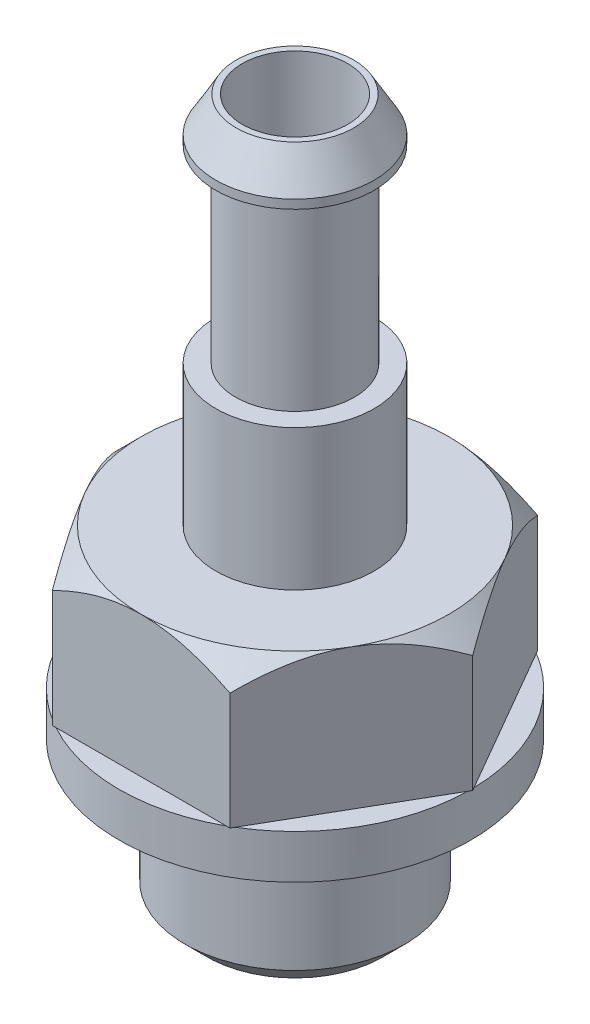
ISO-10303-21;
HEADER;
FILE_DESCRIPTION(('STEP AP214'),'2;1');
FILE_NAME('part.step','',(''),(''),'','','');
FILE_SCHEMA(('AUTOMOTIVE_DESIGN { 1 0 10303 214 1 1 1 1 }'));
ENDSEC;
DATA;
#1=APPLICATION_CONTEXT('core data for automotive mechanical design processes');
#2=APPLICATION_PROTOCOL_DEFINITION('international standard','automotive_design',2000,#1);
#3=PRODUCT_CONTEXT('',#1,'mechanical');
#4=PRODUCT('Part','Part','',(#3));
#5=PRODUCT_RELATED_PRODUCT_CATEGORY('part','',(#4));
#6=PRODUCT_DEFINITION_FORMATION('','',#4);
#7=PRODUCT_DEFINITION_CONTEXT('part definition',#1,'design');
#8=PRODUCT_DEFINITION('design','',#6,#7);
#9=PRODUCT_DEFINITION_SHAPE('','',#8);
#10=(LENGTH_UNIT() NAMED_UNIT(*) SI_UNIT(.MILLI.,.METRE.));
#11=(NAMED_UNIT(*) PLANE_ANGLE_UNIT() SI_UNIT($,.RADIAN.));
#12=(NAMED_UNIT(*) SI_UNIT($,.STERADIAN.) SOLID_ANGLE_UNIT());
#13=UNCERTAINTY_MEASURE_WITH_UNIT(LENGTH_MEASURE(1.E-05),#10,'distance_accuracy_value','');
#14=(GEOMETRIC_REPRESENTATION_CONTEXT(3) GLOBAL_UNCERTAINTY_ASSIGNED_CONTEXT((#13)) GLOBAL_UNIT_ASSIGNED_CONTEXT((#10,
#11,#12)) REPRESENTATION_CONTEXT('',''));
#15=CARTESIAN_POINT('',(0.,0.,0.));
#16=DIRECTION('',(0.,0.,1.));
#17=DIRECTION('',(1.,0.,0.));
#18=AXIS2_PLACEMENT_3D('',#15,#16,#17);
#19=CARTESIAN_POINT('',(0.,7.49999999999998,0.));
#20=DIRECTION('',(0.,-1.,0.));
#21=DIRECTION('',(0.,0.,-1.));
#22=AXIS2_PLACEMENT_3D('',#19,#20,#21);
#23=CONICAL_SURFACE('',#22,3.5,0.785398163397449);
#24=CARTESIAN_POINT('',(-2.0206104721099,6.95843264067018,-3.50020000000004));
#25=CARTESIAN_POINT('',(-2.09007076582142,7.02783218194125,-3.37989124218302));
#26=CARTESIAN_POINT('',(-2.16069251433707,7.09315563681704,-3.25757078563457));
#27=CARTESIAN_POINT('',(-2.30469791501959,7.21276106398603,-3.00814611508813));
#28=CARTESIAN_POINT('',(-2.37809526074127,7.26697649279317,-2.88101818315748));
#29=CARTESIAN_POINT('',(-2.52609746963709,7.35984844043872,-2.62467083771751));
#30=CARTESIAN_POINT('',(-2.60066464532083,7.39873837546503,-2.49551670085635));
#31=CARTESIAN_POINT('',(-2.75144053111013,7.45865621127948,-2.23436520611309));
#32=CARTESIAN_POINT('',(-2.82764463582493,7.47972883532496,-2.10237582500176));
#33=CARTESIAN_POINT('',(-2.95898000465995,7.49874200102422,-1.8748962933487));
#34=CARTESIAN_POINT('',(-3.01394167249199,7.50155641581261,-1.77969989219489));
#35=CARTESIAN_POINT('',(-3.12377560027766,7.4968134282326,-1.58946194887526));
#36=CARTESIAN_POINT('',(-3.17864782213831,7.48925238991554,-1.49442047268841));
#37=CARTESIAN_POINT('',(-3.28787240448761,7.46419021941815,-1.30523794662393));
#38=CARTESIAN_POINT('',(-3.34222411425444,7.44667796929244,-1.21109802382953));
#39=CARTESIAN_POINT('',(-3.44999406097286,7.40266921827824,-1.02443500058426));
#40=CARTESIAN_POINT('',(-3.50341236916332,7.37617340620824,-0.931911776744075));
#41=CARTESIAN_POINT('',(-3.5982441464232,7.32166014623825,-0.767658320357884));
#42=CARTESIAN_POINT('',(-3.63986754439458,7.29507581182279,-0.695564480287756));
#43=CARTESIAN_POINT('',(-3.722367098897,7.23762274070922,-0.552671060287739));
#44=CARTESIAN_POINT('',(-3.76324323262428,7.20675387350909,-0.481871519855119));
#45=CARTESIAN_POINT('',(-3.84411947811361,7.14142377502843,-0.341789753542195));
#46=CARTESIAN_POINT('',(-3.88412189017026,7.10697384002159,-0.272503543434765));
#47=CARTESIAN_POINT('',(-3.96338588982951,7.03493401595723,-0.135214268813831));
#48=CARTESIAN_POINT('',(-4.00264791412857,6.99734605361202,-0.0672104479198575));
#49=CARTESIAN_POINT('',(-4.04156735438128,6.95843264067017,0.000199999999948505));
#50=B_SPLINE_CURVE_WITH_KNOTS('',3,(#24,#25,#26,#27,#28,#29,#30,#31,#32,#33,#34,#35,#36,#37,#38,
#39,#40,#41,#42,#43,#44,#45,#46,#47,#48,#49),.UNSPECIFIED.,.F.,.F.,(4,2,2,2,2,2,2,2,2,2,2,2,4),
(0.,0.466195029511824,0.935106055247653,1.39657035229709,1.85687285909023,2.18628459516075,
2.5158117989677,2.84570789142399,3.17557869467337,3.43762138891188,3.69967206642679,
3.96091985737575,4.22200840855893),.UNSPECIFIED.);
#51=CARTESIAN_POINT('',(-3.03108891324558,7.49999999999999,-1.75000000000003));
#52=VERTEX_POINT('',#51);
#53=CARTESIAN_POINT('',(-4.04145188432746,6.95854811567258,0.));
#54=VERTEX_POINT('',#53);
#55=EDGE_CURVE('E567',#52,#54,#50,.T.);
#56=ORIENTED_EDGE('',*,*,#55,.T.);
#57=CARTESIAN_POINT('',(-4.04156735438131,6.95843264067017,-0.000200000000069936));
#58=CARTESIAN_POINT('',(-3.97210706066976,7.02783218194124,0.120108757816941));
#59=CARTESIAN_POINT('',(-3.9014853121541,7.09315563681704,0.242429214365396));
#60=CARTESIAN_POINT('',(-3.75747991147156,7.21276106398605,0.491853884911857));
#61=CARTESIAN_POINT('',(-3.68408256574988,7.26697649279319,0.618981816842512));
#62=CARTESIAN_POINT('',(-3.53608035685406,7.35984844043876,0.875329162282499));
#63=CARTESIAN_POINT('',(-3.46151318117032,7.39873837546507,1.00448329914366));
#64=CARTESIAN_POINT('',(-3.31073729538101,7.45865621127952,1.26563479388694));
#65=CARTESIAN_POINT('',(-3.23453319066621,7.47972883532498,1.39762417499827));
#66=CARTESIAN_POINT('',(-3.10319782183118,7.49874200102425,1.62510370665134));
#67=CARTESIAN_POINT('',(-3.04823615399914,7.50155641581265,1.72030010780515));
#68=CARTESIAN_POINT('',(-2.93840222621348,7.49681342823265,1.91053805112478));
#69=CARTESIAN_POINT('',(-2.88353000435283,7.48925238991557,2.00557952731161));
#70=CARTESIAN_POINT('',(-2.77430542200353,7.46419021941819,2.19476205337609));
#71=CARTESIAN_POINT('',(-2.71995371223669,7.4466779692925,2.28890197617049));
#72=CARTESIAN_POINT('',(-2.61218376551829,7.40266921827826,2.47556499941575));
#73=CARTESIAN_POINT('',(-2.55876545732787,7.3761734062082,2.56808822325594));
#74=CARTESIAN_POINT('',(-2.46393368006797,7.32166014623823,2.73234167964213));
#75=CARTESIAN_POINT('',(-2.42231028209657,7.29507581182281,2.80443551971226));
#76=CARTESIAN_POINT('',(-2.33981072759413,7.23762274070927,2.94732893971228));
#77=CARTESIAN_POINT('',(-2.29893459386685,7.20675387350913,3.0181284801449));
#78=CARTESIAN_POINT('',(-2.21805834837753,7.14142377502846,3.15821024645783));
#79=CARTESIAN_POINT('',(-2.17805593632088,7.10697384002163,3.22749645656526));
#80=CARTESIAN_POINT('',(-2.09879193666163,7.03493401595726,3.36478573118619));
#81=CARTESIAN_POINT('',(-2.05952991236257,6.99734605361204,3.43278955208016));
#82=CARTESIAN_POINT('',(-2.02061047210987,6.95843264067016,3.50019999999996));
#83=B_SPLINE_CURVE_WITH_KNOTS('',3,(#57,#58,#59,#60,#61,#62,#63,#64,#65,#66,#67,#68,#69,#70,#71,
#72,#73,#74,#75,#76,#77,#78,#79,#80,#81,#82),.UNSPECIFIED.,.F.,.F.,(4,2,2,2,2,2,2,2,2,2,2,2,4),
(0.,0.466195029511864,0.935106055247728,1.39657035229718,1.85687285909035,2.18628459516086,
2.5158117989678,2.84570789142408,3.17557869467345,3.43762138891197,3.69967206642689,
3.96091985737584,4.22200840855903),.UNSPECIFIED.);
#84=CARTESIAN_POINT('',(-3.03108891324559,7.49999999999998,1.74999999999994));
#85=VERTEX_POINT('',#84);
#86=EDGE_CURVE('E175',#54,#85,#83,.T.);
#87=ORIENTED_EDGE('',*,*,#86,.T.);
#88=CARTESIAN_POINT('',(0.,7.49999999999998,0.));
#89=DIRECTION('',(0.,-1.,0.));
#90=DIRECTION('',(0.,0.,-1.));
#91=AXIS2_PLACEMENT_3D('',#88,#89,#90);
#92=CIRCLE('',#91,3.5);
#93=EDGE_CURVE('E414',#85,#52,#92,.T.);
#94=ORIENTED_EDGE('',*,*,#93,.T.);
#95=EDGE_LOOP('',(#56,#87,#94));
#96=FACE_BOUND('',#95,.T.);
#97=ADVANCED_FACE('F38',(#96),#23,.T.);
#98=CARTESIAN_POINT('',(-2.02072594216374,6.9585481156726,-3.50000000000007));
#99=VERTEX_POINT('',#98);
#100=EDGE_CURVE('E199',#99,#52,#50,.T.);
#101=ORIENTED_EDGE('',*,*,#100,.T.);
#102=CARTESIAN_POINT('',(0.,7.50000000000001,-3.50000000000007));
#103=VERTEX_POINT('',#102);
#104=EDGE_CURVE('E350',#52,#103,#92,.T.);
#105=ORIENTED_EDGE('',*,*,#104,.T.);
#106=CARTESIAN_POINT('',(-4.6143977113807,5.20839691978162,-3.50000000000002));
#107=CARTESIAN_POINT('',(-4.50427496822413,5.29611700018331,-3.50000000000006));
#108=CARTESIAN_POINT('',(-4.39360630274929,5.38316173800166,-3.50000000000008));
#109=CARTESIAN_POINT('',(-4.17093883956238,5.55558003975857,-3.50000000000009));
#110=CARTESIAN_POINT('',(-4.05893976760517,5.64095324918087,-3.50000000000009));
#111=CARTESIAN_POINT('',(-3.8325654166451,5.810309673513,-3.50000000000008));
#112=CARTESIAN_POINT('',(-3.71817856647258,5.89427746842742,-3.50000000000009));
#113=CARTESIAN_POINT('',(-3.48759015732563,6.05967341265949,-3.50000000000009));
#114=CARTESIAN_POINT('',(-3.37138871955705,6.14110173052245,-3.50000000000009));
#115=CARTESIAN_POINT('',(-3.12778926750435,6.30697335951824,-3.50000000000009));
#116=CARTESIAN_POINT('',(-3.0002189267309,6.39116482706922,-3.50000000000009));
#117=CARTESIAN_POINT('',(-2.74207212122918,6.5548909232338,-3.50000000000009));
#118=CARTESIAN_POINT('',(-2.6114950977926,6.63442467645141,-3.50000000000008));
#119=CARTESIAN_POINT('',(-2.34720341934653,6.78719022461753,-3.50000000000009));
#120=CARTESIAN_POINT('',(-2.21349941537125,6.86044030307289,-3.5000000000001));
#121=CARTESIAN_POINT('',(-1.94206917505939,6.99899765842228,-3.50000000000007));
#122=CARTESIAN_POINT('',(-1.80434502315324,7.06430896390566,-3.50000000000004));
#123=CARTESIAN_POINT('',(-1.54267178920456,7.17668049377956,-3.50000000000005));
#124=CARTESIAN_POINT('',(-1.41927345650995,7.22501037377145,-3.50000000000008));
#125=CARTESIAN_POINT('',(-1.16898948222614,7.31180632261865,-3.5000000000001));
#126=CARTESIAN_POINT('',(-1.04210364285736,7.35027183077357,-3.50000000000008));
#127=CARTESIAN_POINT('',(-0.78804030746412,7.41443836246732,-3.50000000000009));
#128=CARTESIAN_POINT('',(-0.660929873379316,7.44040013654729,-3.5000000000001));
#129=CARTESIAN_POINT('',(-0.404685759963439,7.47895464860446,-3.50000000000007));
#130=CARTESIAN_POINT('',(-0.275552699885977,7.49155140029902,-3.50000000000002));
#131=CARTESIAN_POINT('',(-0.0247493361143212,7.5020146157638,-3.50000000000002));
#132=CARTESIAN_POINT('',(0.0968846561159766,7.50074994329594,-3.50000000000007));
#133=CARTESIAN_POINT('',(0.3393661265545,7.48566932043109,-3.5000000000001));
#134=CARTESIAN_POINT('',(0.460213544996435,7.47185242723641,-3.50000000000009));
#135=CARTESIAN_POINT('',(0.702319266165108,7.43227013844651,-3.50000000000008));
#136=CARTESIAN_POINT('',(0.823539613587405,7.40627696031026,-3.50000000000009));
#137=CARTESIAN_POINT('',(1.06322932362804,7.34390255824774,-3.50000000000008));
#138=CARTESIAN_POINT('',(1.18169867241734,7.30752128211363,-3.50000000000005));
#139=CARTESIAN_POINT('',(1.41568008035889,7.22612911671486,-3.50000000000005));
#140=CARTESIAN_POINT('',(1.53119014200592,7.1811125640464,-3.50000000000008));
#141=CARTESIAN_POINT('',(1.7592481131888,7.08409694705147,-3.5000000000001));
#142=CARTESIAN_POINT('',(1.87179511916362,7.03209578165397,-3.50000000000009));
#143=CARTESIAN_POINT('',(2.09446060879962,6.92233497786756,-3.50000000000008));
#144=CARTESIAN_POINT('',(2.20457037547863,6.86455780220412,-3.50000000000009));
#145=CARTESIAN_POINT('',(2.42227645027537,6.7445118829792,-3.50000000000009));
#146=CARTESIAN_POINT('',(2.52987312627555,6.68224380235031,-3.50000000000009));
#147=CARTESIAN_POINT('',(2.73761378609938,6.55725390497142,-3.50000000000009));
#148=CARTESIAN_POINT('',(2.83786330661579,6.49470656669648,-3.50000000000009));
#149=CARTESIAN_POINT('',(3.03663978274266,6.36692451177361,-3.50000000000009));
#150=CARTESIAN_POINT('',(3.13516661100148,6.3016895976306,-3.50000000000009));
#151=CARTESIAN_POINT('',(3.32994122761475,6.16953192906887,-3.50000000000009));
#152=CARTESIAN_POINT('',(3.42620087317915,6.10262658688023,-3.50000000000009));
#153=CARTESIAN_POINT('',(3.61739610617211,5.96700290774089,-3.50000000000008));
#154=CARTESIAN_POINT('',(3.71233205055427,5.89828507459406,-3.50000000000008));
#155=CARTESIAN_POINT('',(3.80671185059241,5.82882459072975,-3.50000000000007));
#156=B_SPLINE_CURVE_WITH_KNOTS('',3,(#106,#107,#108,#109,#110,#111,#112,#113,#114,#115,#116,
#117,#118,#119,#120,#121,#122,#123,#124,#125,#126,#127,#128,#129,#130,#131,#132,#133,#134,#135,
#136,#137,#138,#139,#140,#141,#142,#143,#144,#145,#146,#147,#148,#149,#150,#151,#152,#153,#154,
#155),.UNSPECIFIED.,.F.,.F.,(4,2,2,2,2,2,2,2,2,2,2,2,2,2,2,2,2,2,2,2,2,2,2,2,4),(0.,
0.422376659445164,0.84484195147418,1.27050616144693,1.69614205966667,2.15460591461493,
2.61315566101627,3.07032240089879,3.52725617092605,3.92449996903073,4.32176634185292,
4.71034488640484,5.09880670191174,5.46306562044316,5.82735190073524,6.19874306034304,
6.57013608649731,6.94177352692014,7.31352301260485,7.68643762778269,8.05929730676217,
8.41373165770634,8.76819210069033,9.11985139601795,9.4714139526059),.UNSPECIFIED.);
#157=EDGE_CURVE('E210',#103,#99,#156,.F.);
#158=ORIENTED_EDGE('',*,*,#157,.T.);
#159=EDGE_LOOP('',(#101,#105,#158));
#160=FACE_BOUND('',#159,.T.);
#161=ADVANCED_FACE('F242',(#160),#23,.T.);
#162=CARTESIAN_POINT('',(2.02072594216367,6.95854811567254,-3.50000000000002));
#163=VERTEX_POINT('',#162);
#164=EDGE_CURVE('E204',#163,#103,#156,.F.);
#165=ORIENTED_EDGE('',*,*,#164,.T.);
#166=CARTESIAN_POINT('',(3.03108891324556,7.49999999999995,-1.75000000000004));
#167=VERTEX_POINT('',#166);
#168=EDGE_CURVE('E352',#103,#167,#92,.T.);
#169=ORIENTED_EDGE('',*,*,#168,.T.);
#170=CARTESIAN_POINT('',(4.04156735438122,6.95843264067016,0.000199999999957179));
#171=CARTESIAN_POINT('',(3.9721070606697,7.02783218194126,-0.120108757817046));
#172=CARTESIAN_POINT('',(3.90148531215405,7.09315563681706,-0.242429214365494));
#173=CARTESIAN_POINT('',(3.75747991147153,7.21276106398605,-0.491853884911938));
#174=CARTESIAN_POINT('',(3.68408256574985,7.26697649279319,-0.618981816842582));
#175=CARTESIAN_POINT('',(3.53608035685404,7.35984844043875,-0.875329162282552));
#176=CARTESIAN_POINT('',(3.4615131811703,7.39873837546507,-1.00448329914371));
#177=CARTESIAN_POINT('',(3.31073729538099,7.45865621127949,-1.26563479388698));
#178=CARTESIAN_POINT('',(3.23453319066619,7.47972883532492,-1.39762417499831));
#179=CARTESIAN_POINT('',(3.10319782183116,7.4987420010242,-1.62510370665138));
#180=CARTESIAN_POINT('',(3.04823615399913,7.50155641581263,-1.72030010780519));
#181=CARTESIAN_POINT('',(2.93840222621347,7.49681342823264,-1.91053805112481));
#182=CARTESIAN_POINT('',(2.88353000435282,7.48925238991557,-2.00557952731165));
#183=CARTESIAN_POINT('',(2.77430542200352,7.46419021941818,-2.19476205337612));
#184=CARTESIAN_POINT('',(2.71995371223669,7.44667796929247,-2.28890197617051));
#185=CARTESIAN_POINT('',(2.61218376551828,7.40266921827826,-2.47556499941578));
#186=CARTESIAN_POINT('',(2.55876545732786,7.37617340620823,-2.56808822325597));
#187=CARTESIAN_POINT('',(2.46393368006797,7.32166014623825,-2.73234167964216));
#188=CARTESIAN_POINT('',(2.42231028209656,7.29507581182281,-2.80443551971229));
#189=CARTESIAN_POINT('',(2.33981072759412,7.23762274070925,-2.94732893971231));
#190=CARTESIAN_POINT('',(2.29893459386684,7.20675387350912,-3.01812848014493));
#191=CARTESIAN_POINT('',(2.21805834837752,7.14142377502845,-3.15821024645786));
#192=CARTESIAN_POINT('',(2.17805593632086,7.10697384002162,-3.2274964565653));
#193=CARTESIAN_POINT('',(2.09879193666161,7.03493401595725,-3.36478573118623));
#194=CARTESIAN_POINT('',(2.05952991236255,6.99734605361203,-3.43278955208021));
#195=CARTESIAN_POINT('',(2.02061047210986,6.95843264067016,-3.50020000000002));
#196=B_SPLINE_CURVE_WITH_KNOTS('',3,(#170,#171,#172,#173,#174,#175,#176,#177,#178,#179,#180,
#181,#182,#183,#184,#185,#186,#187,#188,#189,#190,#191,#192,#193,#194,#195),.UNSPECIFIED.,.F.,
.F.,(4,2,2,2,2,2,2,2,2,2,2,2,4),(0.,0.466195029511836,0.935106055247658,1.39657035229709,
1.85687285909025,2.18628459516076,2.51581179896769,2.84570789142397,3.17557869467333,
3.43762138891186,3.69967206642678,3.96091985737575,4.22200840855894),.UNSPECIFIED.);
#197=EDGE_CURVE('E209',#167,#163,#196,.T.);
#198=ORIENTED_EDGE('',*,*,#197,.T.);
#199=EDGE_LOOP('',(#165,#169,#198));
#200=FACE_BOUND('',#199,.T.);
#201=ADVANCED_FACE('F568',(#200),#23,.T.);
#202=CARTESIAN_POINT('',(-2.0207259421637,6.95854811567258,3.49999999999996));
#203=VERTEX_POINT('',#202);
#204=EDGE_CURVE('E168',#85,#203,#83,.T.);
#205=ORIENTED_EDGE('',*,*,#204,.T.);
#206=CARTESIAN_POINT('',(-4.61439770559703,5.20839692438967,3.5));
#207=CARTESIAN_POINT('',(-4.50427496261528,5.29611700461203,3.49999999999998));
#208=CARTESIAN_POINT('',(-4.39360629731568,5.38316174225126,3.49999999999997));
#209=CARTESIAN_POINT('',(-4.17093883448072,5.55558004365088,3.49999999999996));
#210=CARTESIAN_POINT('',(-4.05893976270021,5.640953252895,3.49999999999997));
#211=CARTESIAN_POINT('',(-3.83256541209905,5.81030967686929,3.49999999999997));
#212=CARTESIAN_POINT('',(-3.71817856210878,5.89427747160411,3.49999999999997));
#213=CARTESIAN_POINT('',(-3.48759015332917,6.05967341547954,3.49999999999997));
#214=CARTESIAN_POINT('',(-3.37138871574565,6.14110173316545,3.49999999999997));
#215=CARTESIAN_POINT('',(-3.12778926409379,6.30697336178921,3.49999999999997));
#216=CARTESIAN_POINT('',(-3.00021892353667,6.39116482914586,3.49999999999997));
#217=CARTESIAN_POINT('',(-2.74207211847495,6.55489092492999,3.49999999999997));
#218=CARTESIAN_POINT('',(-2.61149509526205,6.63442467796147,3.49999999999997));
#219=CARTESIAN_POINT('',(-2.34720341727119,6.78719022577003,3.49999999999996));
#220=CARTESIAN_POINT('',(-2.21349941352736,6.86044030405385,3.49999999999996));
#221=CARTESIAN_POINT('',(-1.94206917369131,6.9989976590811,3.49999999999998));
#222=CARTESIAN_POINT('',(-1.8043450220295,7.06430896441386,3.50000000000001));
#223=CARTESIAN_POINT('',(-1.54267178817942,7.1766804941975,3.50000000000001));
#224=CARTESIAN_POINT('',(-1.41927345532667,7.2250103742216,3.49999999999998));
#225=CARTESIAN_POINT('',(-1.16898948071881,7.31180632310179,3.49999999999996));
#226=CARTESIAN_POINT('',(-1.04210364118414,7.3502718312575,3.49999999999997));
#227=CARTESIAN_POINT('',(-0.788040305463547,7.41443836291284,3.49999999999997));
#228=CARTESIAN_POINT('',(-0.660929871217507,7.44040013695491,3.49999999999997));
#229=CARTESIAN_POINT('',(-0.404685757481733,7.47895464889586,3.49999999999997));
#230=CARTESIAN_POINT('',(-0.275552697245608,7.49155140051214,3.49999999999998));
#231=CARTESIAN_POINT('',(-0.0247493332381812,7.50201461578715,3.49999999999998));
#232=CARTESIAN_POINT('',(0.0968846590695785,7.50074994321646,3.49999999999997));
#233=CARTESIAN_POINT('',(0.339366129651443,7.4856693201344,3.49999999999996));
#234=CARTESIAN_POINT('',(0.460213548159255,7.47185242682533,3.49999999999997));
#235=CARTESIAN_POINT('',(0.702319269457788,7.43227013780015,3.49999999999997));
#236=CARTESIAN_POINT('',(0.823539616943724,7.40627695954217,3.49999999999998));
#237=CARTESIAN_POINT('',(1.06322932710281,7.34390255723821,3.49999999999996));
#238=CARTESIAN_POINT('',(1.18169867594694,7.30752128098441,3.49999999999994));
#239=CARTESIAN_POINT('',(1.41568008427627,7.22612911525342,3.49999999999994));
#240=CARTESIAN_POINT('',(1.5311901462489,7.18111256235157,3.49999999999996));
#241=CARTESIAN_POINT('',(1.75924811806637,7.08409694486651,3.49999999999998));
#242=CARTESIAN_POINT('',(1.87179512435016,7.03209577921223,3.49999999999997));
#243=CARTESIAN_POINT('',(2.094460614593,6.92233497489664,3.49999999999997));
#244=CARTESIAN_POINT('',(2.20457038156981,6.86455779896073,3.49999999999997));
#245=CARTESIAN_POINT('',(2.42227645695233,6.74451187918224,3.49999999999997));
#246=CARTESIAN_POINT('',(2.52987313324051,6.68224379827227,3.49999999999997));
#247=CARTESIAN_POINT('',(2.73761379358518,6.55725390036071,3.49999999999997));
#248=CARTESIAN_POINT('',(2.83786331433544,6.49470656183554,3.49999999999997));
#249=CARTESIAN_POINT('',(3.03663979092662,6.36692450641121,3.49999999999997));
#250=CARTESIAN_POINT('',(3.13516661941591,6.30168959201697,3.49999999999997));
#251=CARTESIAN_POINT('',(3.32994123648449,6.16953192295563,3.49999999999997));
#252=CARTESIAN_POINT('',(3.42620088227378,6.10262658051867,3.49999999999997));
#253=CARTESIAN_POINT('',(3.61739611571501,5.96700290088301,3.49999999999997));
#254=CARTESIAN_POINT('',(3.71233206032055,5.89828506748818,3.49999999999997));
#255=CARTESIAN_POINT('',(3.80671186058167,5.82882458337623,3.49999999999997));
#256=B_SPLINE_CURVE_WITH_KNOTS('',3,(#206,#207,#208,#209,#210,#211,#212,#213,#214,#215,#216,
#217,#218,#219,#220,#221,#222,#223,#224,#225,#226,#227,#228,#229,#230,#231,#232,#233,#234,#235,
#236,#237,#238,#239,#240,#241,#242,#243,#244,#245,#246,#247,#248,#249,#250,#251,#252,#253,#254,
#255),.UNSPECIFIED.,.F.,.F.,(4,2,2,2,2,2,2,2,2,2,2,2,2,2,2,2,2,2,2,2,2,2,2,2,4),(0.,
0.422376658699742,0.844841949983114,1.27050615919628,1.69614205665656,2.15460591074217,
2.61315565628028,3.07032239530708,3.52725616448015,3.92449996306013,4.32176633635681,
4.71034488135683,5.09880669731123,5.46306561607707,5.82735189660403,6.19874305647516,
6.57013608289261,6.94177352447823,7.31352301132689,7.68643762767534,8.05929730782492,
8.41373165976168,8.76819210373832,9.11985140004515,9.47141395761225),.UNSPECIFIED.);
#257=CARTESIAN_POINT('',(0.,7.50000000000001,3.50000000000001));
#258=VERTEX_POINT('',#257);
#259=EDGE_CURVE('E166',#203,#258,#256,.T.);
#260=ORIENTED_EDGE('',*,*,#259,.T.);
#261=EDGE_CURVE('E420',#258,#85,#92,.T.);
#262=ORIENTED_EDGE('',*,*,#261,.T.);
#263=EDGE_LOOP('',(#205,#260,#262));
#264=FACE_BOUND('',#263,.T.);
#265=ADVANCED_FACE('F428',(#264),#23,.T.);
#266=CARTESIAN_POINT('',(4.04145188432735,6.95854811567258,0.));
#267=VERTEX_POINT('',#266);
#268=EDGE_CURVE('E211',#267,#167,#196,.T.);
#269=ORIENTED_EDGE('',*,*,#268,.T.);
#270=CARTESIAN_POINT('',(3.0310889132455,7.49999999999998,1.75000000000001));
#271=VERTEX_POINT('',#270);
#272=EDGE_CURVE('E356',#167,#271,#92,.T.);
#273=ORIENTED_EDGE('',*,*,#272,.T.);
#274=CARTESIAN_POINT('',(2.02061047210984,6.95843264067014,3.50019999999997));
#275=CARTESIAN_POINT('',(2.09007076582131,7.02783218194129,3.37989124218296));
#276=CARTESIAN_POINT('',(2.16069251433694,7.09315563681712,3.25757078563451));
#277=CARTESIAN_POINT('',(2.30469791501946,7.21276106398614,3.00814611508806));
#278=CARTESIAN_POINT('',(2.37809526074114,7.26697649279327,2.88101818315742));
#279=CARTESIAN_POINT('',(2.52609746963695,7.35984844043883,2.62467083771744));
#280=CARTESIAN_POINT('',(2.60066464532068,7.39873837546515,2.49551670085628));
#281=CARTESIAN_POINT('',(2.75144053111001,7.45865621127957,2.23436520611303));
#282=CARTESIAN_POINT('',(2.82764463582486,7.479728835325,2.10237582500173));
#283=CARTESIAN_POINT('',(2.95898000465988,7.49874200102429,1.87489629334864));
#284=CARTESIAN_POINT('',(3.01394167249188,7.50155641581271,1.77969989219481));
#285=CARTESIAN_POINT('',(3.12377560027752,7.49681342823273,1.58946194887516));
#286=CARTESIAN_POINT('',(3.17864782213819,7.48925238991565,1.49442047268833));
#287=CARTESIAN_POINT('',(3.28787240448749,7.46419021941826,1.30523794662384));
#288=CARTESIAN_POINT('',(3.34222411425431,7.44667796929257,1.21109802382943));
#289=CARTESIAN_POINT('',(3.44999406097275,7.40266921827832,1.02443500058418));
#290=CARTESIAN_POINT('',(3.50341236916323,7.37617340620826,0.93191177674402));
#291=CARTESIAN_POINT('',(3.59824414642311,7.32166014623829,0.767658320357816));
#292=CARTESIAN_POINT('',(3.63986754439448,7.29507581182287,0.695564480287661));
#293=CARTESIAN_POINT('',(3.72236709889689,7.23762274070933,0.552671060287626));
#294=CARTESIAN_POINT('',(3.76324323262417,7.20675387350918,0.481871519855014));
#295=CARTESIAN_POINT('',(3.8441194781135,7.14142377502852,0.341789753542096));
#296=CARTESIAN_POINT('',(3.88412189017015,7.10697384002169,0.272503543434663));
#297=CARTESIAN_POINT('',(3.9633858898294,7.03493401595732,0.135214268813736));
#298=CARTESIAN_POINT('',(4.00264791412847,6.9973460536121,0.0672104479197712));
#299=CARTESIAN_POINT('',(4.0415673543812,6.95843264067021,-0.000200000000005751));
#300=B_SPLINE_CURVE_WITH_KNOTS('',3,(#274,#275,#276,#277,#278,#279,#280,#281,#282,#283,#284,
#285,#286,#287,#288,#289,#290,#291,#292,#293,#294,#295,#296,#297,#298,#299),.UNSPECIFIED.,.F.,
.F.,(4,2,2,2,2,2,2,2,2,2,2,2,4),(0.,0.466195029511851,0.935106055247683,1.39657035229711,
1.85687285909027,2.18628459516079,2.51581179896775,2.84570789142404,3.17557869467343,
3.43762138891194,3.69967206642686,3.96091985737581,4.22200840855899),.UNSPECIFIED.);
#301=EDGE_CURVE('E53',#271,#267,#300,.T.);
#302=ORIENTED_EDGE('',*,*,#301,.T.);
#303=EDGE_LOOP('',(#269,#273,#302));
#304=FACE_BOUND('',#303,.T.);
#305=ADVANCED_FACE('F431',(#304),#23,.T.);
#306=CARTESIAN_POINT('',(2.02072594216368,6.95854811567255,3.49999999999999));
#307=VERTEX_POINT('',#306);
#308=EDGE_CURVE('E155',#258,#307,#256,.T.);
#309=ORIENTED_EDGE('',*,*,#308,.T.);
#310=EDGE_CURVE('E142',#307,#271,#300,.T.);
#311=ORIENTED_EDGE('',*,*,#310,.T.);
#312=EDGE_CURVE('E165',#271,#258,#92,.T.);
#313=ORIENTED_EDGE('',*,*,#312,.T.);
#314=EDGE_LOOP('',(#309,#311,#313));
#315=FACE_BOUND('',#314,.T.);
#316=ADVANCED_FACE('F164',(#315),#23,.T.);
#317=CARTESIAN_POINT('',(-4.00000000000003,4.29999999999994,0.));
#318=DIRECTION('',(0.,1.,0.));
#319=DIRECTION('',(0.,0.,1.));
#320=AXIS2_PLACEMENT_3D('',#317,#318,#319);
#321=PLANE('',#320);
#322=DIRECTION('',(0.500000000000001,0.,0.866025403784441));
#323=VECTOR('',#322,1.);
#324=CARTESIAN_POINT('',(2.02072594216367,4.29999999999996,-3.50000000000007));
#325=LINE('',#324,#323);
#326=CARTESIAN_POINT('',(2.02072594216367,4.29999999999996,-3.50000000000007));
#327=VERTEX_POINT('',#326);
#328=CARTESIAN_POINT('',(2.06284307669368,4.29999999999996,-3.42705098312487));
#329=VERTEX_POINT('',#328);
#330=EDGE_CURVE('E219',#327,#329,#325,.T.);
#331=ORIENTED_EDGE('',*,*,#330,.T.);
#332=CARTESIAN_POINT('',(0.,4.29999999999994,0.));
#333=DIRECTION('',(0.,-1.,0.));
#334=DIRECTION('',(0.,0.,-1.));
#335=AXIS2_PLACEMENT_3D('',#332,#333,#334);
#336=CIRCLE('',#335,4.);
#337=CARTESIAN_POINT('',(1.9364916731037,4.29999999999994,-3.50000000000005));
#338=VERTEX_POINT('',#337);
#339=EDGE_CURVE('E348',#338,#329,#336,.T.);
#340=ORIENTED_EDGE('',*,*,#339,.F.);
#341=DIRECTION('',(-1.,0.,0.));
#342=VECTOR('',#341,1.);
#343=CARTESIAN_POINT('',(-4.00000000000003,4.29999999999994,-3.50000000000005));
#344=LINE('',#343,#342);
#345=EDGE_CURVE('E11',#327,#338,#344,.T.);
#346=ORIENTED_EDGE('',*,*,#345,.F.);
#347=EDGE_LOOP('',(#331,#340,#346));
#348=FACE_BOUND('',#347,.T.);
#349=ADVANCED_FACE('F234',(#348),#321,.F.);
#350=DIRECTION('',(1.,0.,0.));
#351=VECTOR('',#350,1.);
#352=CARTESIAN_POINT('',(-2.02072594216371,4.3,-3.5));
#353=LINE('',#352,#351);
#354=CARTESIAN_POINT('',(-2.02072594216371,4.3,-3.5));
#355=VERTEX_POINT('',#354);
#356=CARTESIAN_POINT('',(-1.93649167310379,4.29999999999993,-3.50000000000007));
#357=VERTEX_POINT('',#356);
#358=EDGE_CURVE('E339',#355,#357,#353,.T.);
#359=ORIENTED_EDGE('',*,*,#358,.T.);
#360=CARTESIAN_POINT('',(-2.06284307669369,4.29999999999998,-3.42705098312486));
#361=VERTEX_POINT('',#360);
#362=EDGE_CURVE('E338',#361,#357,#336,.T.);
#363=ORIENTED_EDGE('',*,*,#362,.F.);
#364=DIRECTION('',(-0.5,0.,0.866025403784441));
#365=VECTOR('',#364,1.);
#366=CARTESIAN_POINT('',(-4.03108891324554,4.30000000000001,-0.0179491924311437));
#367=LINE('',#366,#365);
#368=EDGE_CURVE('E46',#355,#361,#367,.T.);
#369=ORIENTED_EDGE('',*,*,#368,.F.);
#370=EDGE_LOOP('',(#359,#363,#369));
#371=FACE_BOUND('',#370,.T.);
#372=ADVANCED_FACE('F237',(#371),#321,.F.);
#373=DIRECTION('',(0.5,0.,-0.866025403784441));
#374=VECTOR('',#373,1.);
#375=CARTESIAN_POINT('',(-4.04145188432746,4.29999999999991,0.));
#376=LINE('',#375,#374);
#377=CARTESIAN_POINT('',(-4.04145188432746,4.29999999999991,0.));
#378=VERTEX_POINT('',#377);
#379=CARTESIAN_POINT('',(-3.99933474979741,4.29999999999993,-0.0729490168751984));
#380=VERTEX_POINT('',#379);
#381=EDGE_CURVE('E334',#378,#380,#376,.T.);
#382=ORIENTED_EDGE('',*,*,#381,.T.);
#383=CARTESIAN_POINT('',(-3.9993347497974,4.29999999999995,0.0729490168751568));
#384=VERTEX_POINT('',#383);
#385=EDGE_CURVE('E346',#384,#380,#336,.T.);
#386=ORIENTED_EDGE('',*,*,#385,.F.);
#387=DIRECTION('',(0.5,0.,0.866025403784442));
#388=VECTOR('',#387,1.);
#389=CARTESIAN_POINT('',(-4.03108891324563,4.29999999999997,0.0179491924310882));
#390=LINE('',#389,#388);
#391=EDGE_CURVE('E315',#378,#384,#390,.T.);
#392=ORIENTED_EDGE('',*,*,#391,.F.);
#393=EDGE_LOOP('',(#382,#386,#392));
#394=FACE_BOUND('',#393,.T.);
#395=ADVANCED_FACE('F489',(#394),#321,.F.);
#396=DIRECTION('',(-0.5,0.,-0.866025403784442));
#397=VECTOR('',#396,1.);
#398=CARTESIAN_POINT('',(-2.0207259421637,4.29999999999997,3.50000000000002));
#399=LINE('',#398,#397);
#400=CARTESIAN_POINT('',(-2.0207259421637,4.29999999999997,3.50000000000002));
#401=VERTEX_POINT('',#400);
#402=CARTESIAN_POINT('',(-2.06284307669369,4.29999999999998,3.42705098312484));
#403=VERTEX_POINT('',#402);
#404=EDGE_CURVE('E335',#401,#403,#399,.T.);
#405=ORIENTED_EDGE('',*,*,#404,.T.);
#406=CARTESIAN_POINT('',(-1.93649167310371,4.29999999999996,3.5));
#407=VERTEX_POINT('',#406);
#408=EDGE_CURVE('E493',#407,#403,#336,.T.);
#409=ORIENTED_EDGE('',*,*,#408,.F.);
#410=DIRECTION('',(1.,0.,0.));
#411=VECTOR('',#410,1.);
#412=CARTESIAN_POINT('',(-3.99999999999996,4.3,3.50000000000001));
#413=LINE('',#412,#411);
#414=EDGE_CURVE('E312',#401,#407,#413,.T.);
#415=ORIENTED_EDGE('',*,*,#414,.F.);
#416=EDGE_LOOP('',(#405,#409,#415));
#417=FACE_BOUND('',#416,.T.);
#418=ADVANCED_FACE('F689',(#417),#321,.F.);
#419=DIRECTION('',(-1.,0.,0.));
#420=VECTOR('',#419,1.);
#421=CARTESIAN_POINT('',(2.02072594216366,4.29999999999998,3.49999999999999));
#422=LINE('',#421,#420);
#423=CARTESIAN_POINT('',(2.02072594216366,4.29999999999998,3.49999999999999));
#424=VERTEX_POINT('',#423);
#425=CARTESIAN_POINT('',(1.93649167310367,4.29999999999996,3.49999999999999));
#426=VERTEX_POINT('',#425);
#427=EDGE_CURVE('E159',#424,#426,#422,.T.);
#428=ORIENTED_EDGE('',*,*,#427,.T.);
#429=CARTESIAN_POINT('',(2.0628430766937,4.29999999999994,3.42705098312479));
#430=VERTEX_POINT('',#429);
#431=EDGE_CURVE('E495',#430,#426,#336,.T.);
#432=ORIENTED_EDGE('',*,*,#431,.F.);
#433=DIRECTION('',(0.5,0.,-0.866025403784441));
#434=VECTOR('',#433,1.);
#435=CARTESIAN_POINT('',(2.03108891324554,4.29999999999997,3.48205080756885));
#436=LINE('',#435,#434);
#437=EDGE_CURVE('E306',#424,#430,#436,.T.);
#438=ORIENTED_EDGE('',*,*,#437,.F.);
#439=EDGE_LOOP('',(#428,#432,#438));
#440=FACE_BOUND('',#439,.T.);
#441=ADVANCED_FACE('F681',(#440),#321,.F.);
#442=DIRECTION('',(-0.500000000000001,0.,-0.866025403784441));
#443=VECTOR('',#442,1.);
#444=CARTESIAN_POINT('',(2.03108891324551,4.29999999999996,-3.48205080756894));
#445=LINE('',#444,#443);
#446=CARTESIAN_POINT('',(4.04145188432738,4.29999999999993,0.));
#447=VERTEX_POINT('',#446);
#448=CARTESIAN_POINT('',(3.99933474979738,4.29999999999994,-0.0729490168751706));
#449=VERTEX_POINT('',#448);
#450=EDGE_CURVE('E304',#447,#449,#445,.T.);
#451=ORIENTED_EDGE('',*,*,#450,.F.);
#452=DIRECTION('',(-0.5,0.,0.866025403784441));
#453=VECTOR('',#452,1.);
#454=CARTESIAN_POINT('',(4.04145188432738,4.29999999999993,0.));
#455=LINE('',#454,#453);
#456=CARTESIAN_POINT('',(3.99933474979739,4.29999999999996,0.0729490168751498));
#457=VERTEX_POINT('',#456);
#458=EDGE_CURVE('E434',#447,#457,#455,.T.);
#459=ORIENTED_EDGE('',*,*,#458,.T.);
#460=EDGE_CURVE('E462',#449,#457,#336,.T.);
#461=ORIENTED_EDGE('',*,*,#460,.F.);
#462=EDGE_LOOP('',(#451,#459,#461));
#463=FACE_BOUND('',#462,.T.);
#464=ADVANCED_FACE('F239',(#463),#321,.F.);
#465=CARTESIAN_POINT('',(0.,0.,0.));
#466=DIRECTION('',(0.,-1.,0.));
#467=DIRECTION('',(0.,0.,-1.));
#468=AXIS2_PLACEMENT_3D('',#465,#466,#467);
#469=CYLINDRICAL_SURFACE('',#468,4.);
#470=CARTESIAN_POINT('',(0.,3.29999999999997,0.));
#471=DIRECTION('',(0.,-1.,0.));
#472=DIRECTION('',(0.,0.,-1.));
#473=AXIS2_PLACEMENT_3D('',#470,#471,#472);
#474=CIRCLE('',#473,4.);
#475=CARTESIAN_POINT('',(0.,3.29999999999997,-4.00000000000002));
#476=VERTEX_POINT('',#475);
#477=EDGE_CURVE('E303',#476,#476,#474,.T.);
#478=ORIENTED_EDGE('',*,*,#477,.F.);
#479=EDGE_LOOP('',(#478));
#480=FACE_BOUND('',#479,.T.);
#481=ORIENTED_EDGE('',*,*,#339,.T.);
#482=EDGE_CURVE('E351',#329,#449,#336,.T.);
#483=ORIENTED_EDGE('',*,*,#482,.T.);
#484=ORIENTED_EDGE('',*,*,#460,.T.);
#485=EDGE_CURVE('E464',#457,#430,#336,.T.);
#486=ORIENTED_EDGE('',*,*,#485,.T.);
#487=ORIENTED_EDGE('',*,*,#431,.T.);
#488=EDGE_CURVE('E494',#426,#407,#336,.T.);
#489=ORIENTED_EDGE('',*,*,#488,.T.);
#490=ORIENTED_EDGE('',*,*,#408,.T.);
#491=EDGE_CURVE('E347',#403,#384,#336,.T.);
#492=ORIENTED_EDGE('',*,*,#491,.T.);
#493=ORIENTED_EDGE('',*,*,#385,.T.);
#494=EDGE_CURVE('E333',#380,#361,#336,.T.);
#495=ORIENTED_EDGE('',*,*,#494,.T.);
#496=ORIENTED_EDGE('',*,*,#362,.T.);
#497=EDGE_CURVE('E151',#357,#338,#336,.T.);
#498=ORIENTED_EDGE('',*,*,#497,.T.);
#499=EDGE_LOOP('',(#481,#483,#484,#486,#487,#489,#490,#492,#493,#495,#496,#498));
#500=FACE_BOUND('',#499,.T.);
#501=ADVANCED_FACE('F40',(#480,#500),#469,.T.);
#502=CARTESIAN_POINT('',(-4.00000000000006,3.29999999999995,0.));
#503=DIRECTION('',(0.,1.,0.));
#504=DIRECTION('',(0.,0.,1.));
#505=AXIS2_PLACEMENT_3D('',#502,#503,#504);
#506=PLANE('',#505);
#507=CARTESIAN_POINT('',(0.,3.29999999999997,0.));
#508=DIRECTION('',(0.,-1.,0.));
#509=DIRECTION('',(0.,0.,-1.));
#510=AXIS2_PLACEMENT_3D('',#507,#508,#509);
#511=CIRCLE('',#510,2.5);
#512=CARTESIAN_POINT('',(0.,3.29999999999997,-2.50000000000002));
#513=VERTEX_POINT('',#512);
#514=EDGE_CURVE('E300',#513,#513,#511,.T.);
#515=ORIENTED_EDGE('',*,*,#514,.F.);
#516=EDGE_LOOP('',(#515));
#517=FACE_BOUND('',#516,.T.);
#518=ORIENTED_EDGE('',*,*,#477,.T.);
#519=EDGE_LOOP('',(#518));
#520=FACE_BOUND('',#519,.T.);
#521=ADVANCED_FACE('F289',(#517,#520),#506,.F.);
#522=CARTESIAN_POINT('',(0.,0.,0.));
#523=DIRECTION('',(0.,-1.,0.));
#524=DIRECTION('',(0.,0.,-1.));
#525=AXIS2_PLACEMENT_3D('',#522,#523,#524);
#526=CYLINDRICAL_SURFACE('',#525,2.5);
#527=CARTESIAN_POINT('',(0.,0.499999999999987,0.));
#528=DIRECTION('',(0.,-1.,0.));
#529=DIRECTION('',(0.,0.,-1.));
#530=AXIS2_PLACEMENT_3D('',#527,#528,#529);
#531=CIRCLE('',#530,2.5);
#532=CARTESIAN_POINT('',(0.,0.499999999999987,-2.50000000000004));
#533=VERTEX_POINT('',#532);
#534=EDGE_CURVE('E308',#533,#533,#531,.T.);
#535=ORIENTED_EDGE('',*,*,#534,.F.);
#536=EDGE_LOOP('',(#535));
#537=FACE_BOUND('',#536,.T.);
#538=ORIENTED_EDGE('',*,*,#514,.T.);
#539=EDGE_LOOP('',(#538));
#540=FACE_BOUND('',#539,.T.);
#541=ADVANCED_FACE('F286',(#537,#540),#526,.T.);
#542=CARTESIAN_POINT('',(0.,0.499999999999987,0.));
#543=DIRECTION('',(0.,1.,0.));
#544=DIRECTION('',(0.,0.,1.));
#545=AXIS2_PLACEMENT_3D('',#542,#543,#544);
#546=CONICAL_SURFACE('',#545,2.5,0.785398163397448);
#547=CARTESIAN_POINT('',(0.,0.,0.));
#548=DIRECTION('',(0.,-1.,0.));
#549=DIRECTION('',(0.,0.,-1.));
#550=AXIS2_PLACEMENT_3D('',#547,#548,#549);
#551=CIRCLE('',#550,2.);
#552=CARTESIAN_POINT('',(0.,0.,-2.00000000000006));
#553=VERTEX_POINT('',#552);
#554=EDGE_CURVE('E383',#553,#553,#551,.T.);
#555=ORIENTED_EDGE('',*,*,#554,.F.);
#556=EDGE_LOOP('',(#555));
#557=FACE_BOUND('',#556,.T.);
#558=ORIENTED_EDGE('',*,*,#534,.T.);
#559=EDGE_LOOP('',(#558));
#560=FACE_BOUND('',#559,.T.);
#561=ADVANCED_FACE('F282',(#557,#560),#546,.T.);
#562=CARTESIAN_POINT('',(-1.20000000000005,0.,0.));
#563=DIRECTION('',(0.,1.,0.));
#564=DIRECTION('',(0.,0.,1.));
#565=AXIS2_PLACEMENT_3D('',#562,#563,#564);
#566=PLANE('',#565);
#567=CARTESIAN_POINT('',(0.,0.,0.));
#568=DIRECTION('',(0.,-1.,0.));
#569=DIRECTION('',(0.,0.,-1.));
#570=AXIS2_PLACEMENT_3D('',#567,#568,#569);
#571=CIRCLE('',#570,1.2);
#572=CARTESIAN_POINT('',(0.,0.,-1.20000000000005));
#573=VERTEX_POINT('',#572);
#574=EDGE_CURVE('E380',#573,#573,#571,.T.);
#575=ORIENTED_EDGE('',*,*,#574,.F.);
#576=EDGE_LOOP('',(#575));
#577=FACE_BOUND('',#576,.T.);
#578=ORIENTED_EDGE('',*,*,#554,.T.);
#579=EDGE_LOOP('',(#578));
#580=FACE_BOUND('',#579,.T.);
#581=ADVANCED_FACE('F278',(#577,#580),#566,.F.);
#582=CARTESIAN_POINT('',(0.,0.,0.));
#583=DIRECTION('',(0.,-1.,0.));
#584=DIRECTION('',(0.,0.,-1.));
#585=AXIS2_PLACEMENT_3D('',#582,#583,#584);
#586=CYLINDRICAL_SURFACE('',#585,1.2);
#587=CARTESIAN_POINT('',(0.,16.,0.));
#588=DIRECTION('',(0.,-1.,0.));
#589=DIRECTION('',(0.,0.,-1.));
#590=AXIS2_PLACEMENT_3D('',#587,#588,#589);
#591=CIRCLE('',#590,1.2);
#592=CARTESIAN_POINT('',(0.,16.,-1.2));
#593=VERTEX_POINT('',#592);
#594=EDGE_CURVE('E377',#593,#593,#591,.T.);
#595=ORIENTED_EDGE('',*,*,#594,.F.);
#596=EDGE_LOOP('',(#595));
#597=FACE_BOUND('',#596,.T.);
#598=ORIENTED_EDGE('',*,*,#574,.T.);
#599=EDGE_LOOP('',(#598));
#600=FACE_BOUND('',#599,.T.);
#601=ADVANCED_FACE('F274',(#597,#600),#586,.F.);
#602=CARTESIAN_POINT('',(-1.33811978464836,16.,0.));
#603=DIRECTION('',(0.,-1.,0.));
#604=DIRECTION('',(0.,0.,-1.));
#605=AXIS2_PLACEMENT_3D('',#602,#603,#604);
#606=PLANE('',#605);
#607=CARTESIAN_POINT('',(0.,16.,0.));
#608=DIRECTION('',(0.,-1.,0.));
#609=DIRECTION('',(0.,0.,-1.));
#610=AXIS2_PLACEMENT_3D('',#607,#608,#609);
#611=CIRCLE('',#610,1.3381197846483);
#612=CARTESIAN_POINT('',(0.,16.,-1.3381197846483));
#613=VERTEX_POINT('',#612);
#614=EDGE_CURVE('E374',#613,#613,#611,.T.);
#615=ORIENTED_EDGE('',*,*,#614,.F.);
#616=EDGE_LOOP('',(#615));
#617=FACE_BOUND('',#616,.T.);
#618=ORIENTED_EDGE('',*,*,#594,.T.);
#619=EDGE_LOOP('',(#618));
#620=FACE_BOUND('',#619,.T.);
#621=ADVANCED_FACE('F270',(#617,#620),#606,.F.);
#622=CARTESIAN_POINT('',(0.,16.,0.));
#623=DIRECTION('',(0.,-1.,0.));
#624=DIRECTION('',(0.,0.,-1.));
#625=AXIS2_PLACEMENT_3D('',#622,#623,#624);
#626=CONICAL_SURFACE('',#625,1.3381197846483,0.5235987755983);
#627=CARTESIAN_POINT('',(0.,15.1999999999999,0.));
#628=DIRECTION('',(0.,-1.,0.));
#629=DIRECTION('',(0.,0.,-1.));
#630=AXIS2_PLACEMENT_3D('',#627,#628,#629);
#631=CIRCLE('',#630,1.8);
#632=CARTESIAN_POINT('',(0.,15.1999999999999,-1.8000000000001));
#633=VERTEX_POINT('',#632);
#634=EDGE_CURVE('E371',#633,#633,#631,.T.);
#635=ORIENTED_EDGE('',*,*,#634,.F.);
#636=EDGE_LOOP('',(#635));
#637=FACE_BOUND('',#636,.T.);
#638=ORIENTED_EDGE('',*,*,#614,.T.);
#639=EDGE_LOOP('',(#638));
#640=FACE_BOUND('',#639,.T.);
#641=ADVANCED_FACE('F266',(#637,#640),#626,.T.);
#642=CARTESIAN_POINT('',(0.,0.,0.));
#643=DIRECTION('',(0.,-1.,0.));
#644=DIRECTION('',(0.,0.,-1.));
#645=AXIS2_PLACEMENT_3D('',#642,#643,#644);
#646=CYLINDRICAL_SURFACE('',#645,1.8);
#647=CARTESIAN_POINT('',(0.,14.9999999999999,0.));
#648=DIRECTION('',(0.,-1.,0.));
#649=DIRECTION('',(0.,0.,-1.));
#650=AXIS2_PLACEMENT_3D('',#647,#648,#649);
#651=CIRCLE('',#650,1.8);
#652=CARTESIAN_POINT('',(0.,14.9999999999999,-1.80000000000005));
#653=VERTEX_POINT('',#652);
#654=EDGE_CURVE('E368',#653,#653,#651,.T.);
#655=ORIENTED_EDGE('',*,*,#654,.F.);
#656=EDGE_LOOP('',(#655));
#657=FACE_BOUND('',#656,.T.);
#658=ORIENTED_EDGE('',*,*,#634,.T.);
#659=EDGE_LOOP('',(#658));
#660=FACE_BOUND('',#659,.T.);
#661=ADVANCED_FACE('F262',(#657,#660),#646,.T.);
#662=CARTESIAN_POINT('',(-1.35000000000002,15.,0.));
#663=DIRECTION('',(0.,1.,0.));
#664=DIRECTION('',(0.,0.,1.));
#665=AXIS2_PLACEMENT_3D('',#662,#663,#664);
#666=PLANE('',#665);
#667=CARTESIAN_POINT('',(0.,14.9999999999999,0.));
#668=DIRECTION('',(0.,-1.,0.));
#669=DIRECTION('',(0.,0.,-1.));
#670=AXIS2_PLACEMENT_3D('',#667,#668,#669);
#671=CIRCLE('',#670,1.35);
#672=CARTESIAN_POINT('',(0.,14.9999999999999,-1.35000000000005));
#673=VERTEX_POINT('',#672);
#674=EDGE_CURVE('E365',#673,#673,#671,.T.);
#675=ORIENTED_EDGE('',*,*,#674,.F.);
#676=EDGE_LOOP('',(#675));
#677=FACE_BOUND('',#676,.T.);
#678=ORIENTED_EDGE('',*,*,#654,.T.);
#679=EDGE_LOOP('',(#678));
#680=FACE_BOUND('',#679,.T.);
#681=ADVANCED_FACE('F258',(#677,#680),#666,.F.);
#682=CARTESIAN_POINT('',(0.,0.,0.));
#683=DIRECTION('',(0.,-1.,0.));
#684=DIRECTION('',(0.,0.,-1.));
#685=AXIS2_PLACEMENT_3D('',#682,#683,#684);
#686=CYLINDRICAL_SURFACE('',#685,1.35);
#687=CARTESIAN_POINT('',(0.,10.6999999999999,0.));
#688=DIRECTION('',(0.,-1.,0.));
#689=DIRECTION('',(0.,0.,-1.));
#690=AXIS2_PLACEMENT_3D('',#687,#688,#689);
#691=CIRCLE('',#690,1.35);
#692=CARTESIAN_POINT('',(0.,10.6999999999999,-1.35000000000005));
#693=VERTEX_POINT('',#692);
#694=EDGE_CURVE('E362',#693,#693,#691,.T.);
#695=ORIENTED_EDGE('',*,*,#694,.F.);
#696=EDGE_LOOP('',(#695));
#697=FACE_BOUND('',#696,.T.);
#698=ORIENTED_EDGE('',*,*,#674,.T.);
#699=EDGE_LOOP('',(#698));
#700=FACE_BOUND('',#699,.T.);
#701=ADVANCED_FACE('F254',(#697,#700),#686,.T.);
#702=CARTESIAN_POINT('',(-1.8,10.7,0.));
#703=DIRECTION('',(0.,-1.,0.));
#704=DIRECTION('',(0.,0.,-1.));
#705=AXIS2_PLACEMENT_3D('',#702,#703,#704);
#706=PLANE('',#705);
#707=CARTESIAN_POINT('',(0.,10.6999999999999,0.));
#708=DIRECTION('',(0.,-1.,0.));
#709=DIRECTION('',(0.,0.,-1.));
#710=AXIS2_PLACEMENT_3D('',#707,#708,#709);
#711=CIRCLE('',#710,1.8);
#712=CARTESIAN_POINT('',(0.,10.6999999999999,-1.80000000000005));
#713=VERTEX_POINT('',#712);
#714=EDGE_CURVE('E359',#713,#713,#711,.T.);
#715=ORIENTED_EDGE('',*,*,#714,.F.);
#716=EDGE_LOOP('',(#715));
#717=FACE_BOUND('',#716,.T.);
#718=ORIENTED_EDGE('',*,*,#694,.T.);
#719=EDGE_LOOP('',(#718));
#720=FACE_BOUND('',#719,.T.);
#721=ADVANCED_FACE('F250',(#717,#720),#706,.F.);
#722=CARTESIAN_POINT('',(0.,0.,0.));
#723=DIRECTION('',(0.,-1.,0.));
#724=DIRECTION('',(0.,0.,-1.));
#725=AXIS2_PLACEMENT_3D('',#722,#723,#724);
#726=CYLINDRICAL_SURFACE('',#725,1.8);
#727=CARTESIAN_POINT('',(0.,7.49999999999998,0.));
#728=DIRECTION('',(0.,-1.,0.));
#729=DIRECTION('',(0.,0.,-1.));
#730=AXIS2_PLACEMENT_3D('',#727,#728,#729);
#731=CIRCLE('',#730,1.8);
#732=CARTESIAN_POINT('',(0.,7.49999999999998,-1.80000000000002));
#733=VERTEX_POINT('',#732);
#734=EDGE_CURVE('E355',#733,#733,#731,.T.);
#735=ORIENTED_EDGE('',*,*,#734,.F.);
#736=EDGE_LOOP('',(#735));
#737=FACE_BOUND('',#736,.T.);
#738=ORIENTED_EDGE('',*,*,#714,.T.);
#739=EDGE_LOOP('',(#738));
#740=FACE_BOUND('',#739,.T.);
#741=ADVANCED_FACE('F246',(#737,#740),#726,.T.);
#742=CARTESIAN_POINT('',(-3.50000000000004,7.49999999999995,0.));
#743=DIRECTION('',(0.,-1.,0.));
#744=DIRECTION('',(0.,0.,-1.));
#745=AXIS2_PLACEMENT_3D('',#742,#743,#744);
#746=PLANE('',#745);
#747=ORIENTED_EDGE('',*,*,#168,.F.);
#748=ORIENTED_EDGE('',*,*,#104,.F.);
#749=ORIENTED_EDGE('',*,*,#93,.F.);
#750=ORIENTED_EDGE('',*,*,#261,.F.);
#751=ORIENTED_EDGE('',*,*,#312,.F.);
#752=ORIENTED_EDGE('',*,*,#272,.F.);
#753=EDGE_LOOP('',(#747,#748,#749,#750,#751,#752));
#754=FACE_BOUND('',#753,.T.);
#755=ORIENTED_EDGE('',*,*,#734,.T.);
#756=EDGE_LOOP('',(#755));
#757=FACE_BOUND('',#756,.T.);
#758=ADVANCED_FACE('F232',(#754,#757),#746,.F.);
#759=CARTESIAN_POINT('',(0.,4.29999999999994,0.));
#760=DIRECTION('',(0.,-1.,0.));
#761=DIRECTION('',(0.,0.,-1.));
#762=AXIS2_PLACEMENT_3D('',#759,#760,#761);
#763=PLANE('',#762);
#764=EDGE_CURVE('E218',#329,#449,#325,.T.);
#765=ORIENTED_EDGE('',*,*,#764,.T.);
#766=ORIENTED_EDGE('',*,*,#482,.F.);
#767=EDGE_LOOP('',(#765,#766));
#768=FACE_BOUND('',#767,.T.);
#769=ADVANCED_FACE('F228',(#768),#763,.F.);
#770=EDGE_CURVE('E60',#457,#430,#455,.T.);
#771=ORIENTED_EDGE('',*,*,#770,.T.);
#772=ORIENTED_EDGE('',*,*,#485,.F.);
#773=EDGE_LOOP('',(#771,#772));
#774=FACE_BOUND('',#773,.T.);
#775=ADVANCED_FACE('F231',(#774),#763,.F.);
#776=EDGE_CURVE('E448',#426,#407,#422,.T.);
#777=ORIENTED_EDGE('',*,*,#776,.T.);
#778=ORIENTED_EDGE('',*,*,#488,.F.);
#779=EDGE_LOOP('',(#777,#778));
#780=FACE_BOUND('',#779,.T.);
#781=ADVANCED_FACE('F477',(#780),#763,.F.);
#782=EDGE_CURVE('E447',#403,#384,#399,.T.);
#783=ORIENTED_EDGE('',*,*,#782,.T.);
#784=ORIENTED_EDGE('',*,*,#491,.F.);
#785=EDGE_LOOP('',(#783,#784));
#786=FACE_BOUND('',#785,.T.);
#787=ADVANCED_FACE('F473',(#786),#763,.F.);
#788=EDGE_CURVE('E322',#380,#361,#376,.T.);
#789=ORIENTED_EDGE('',*,*,#788,.T.);
#790=ORIENTED_EDGE('',*,*,#494,.F.);
#791=EDGE_LOOP('',(#789,#790));
#792=FACE_BOUND('',#791,.T.);
#793=ADVANCED_FACE('F331',(#792),#763,.F.);
#794=EDGE_CURVE('E436',#357,#338,#353,.T.);
#795=ORIENTED_EDGE('',*,*,#794,.T.);
#796=ORIENTED_EDGE('',*,*,#497,.F.);
#797=EDGE_LOOP('',(#795,#796));
#798=FACE_BOUND('',#797,.T.);
#799=ADVANCED_FACE('F225',(#798),#763,.F.);
#800=CARTESIAN_POINT('',(2.02072594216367,16.001,-3.50000000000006));
#801=DIRECTION('',(0.86602540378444,0.,-0.500000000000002));
#802=DIRECTION('',(-0.500000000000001,0.,-0.866025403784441));
#803=AXIS2_PLACEMENT_3D('',#800,#801,#802);
#804=PLANE('',#803);
#805=DIRECTION('',(0.,-1.,0.));
#806=VECTOR('',#805,1.);
#807=CARTESIAN_POINT('',(4.04145188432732,16.001,0.));
#808=LINE('',#807,#806);
#809=EDGE_CURVE('E162',#267,#447,#808,.T.);
#810=ORIENTED_EDGE('',*,*,#809,.T.);
#811=ORIENTED_EDGE('',*,*,#450,.T.);
#812=ORIENTED_EDGE('',*,*,#764,.F.);
#813=ORIENTED_EDGE('',*,*,#330,.F.);
#814=DIRECTION('',(0.,-1.,0.));
#815=VECTOR('',#814,1.);
#816=CARTESIAN_POINT('',(2.02072594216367,16.001,-3.50000000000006));
#817=LINE('',#816,#815);
#818=EDGE_CURVE('E443',#163,#327,#817,.T.);
#819=ORIENTED_EDGE('',*,*,#818,.F.);
#820=ORIENTED_EDGE('',*,*,#197,.F.);
#821=ORIENTED_EDGE('',*,*,#268,.F.);
#822=EDGE_LOOP('',(#810,#811,#812,#813,#819,#820,#821));
#823=FACE_BOUND('',#822,.T.);
#824=ADVANCED_FACE('F221',(#823),#804,.T.);
#825=CARTESIAN_POINT('',(-2.0207259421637,16.001,-3.50000000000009));
#826=DIRECTION('',(0.,0.,-1.));
#827=DIRECTION('',(-1.,0.,0.));
#828=AXIS2_PLACEMENT_3D('',#825,#826,#827);
#829=PLANE('',#828);
#830=ORIENTED_EDGE('',*,*,#818,.T.);
#831=ORIENTED_EDGE('',*,*,#345,.T.);
#832=ORIENTED_EDGE('',*,*,#794,.F.);
#833=ORIENTED_EDGE('',*,*,#358,.F.);
#834=DIRECTION('',(0.,-1.,0.));
#835=VECTOR('',#834,1.);
#836=CARTESIAN_POINT('',(-2.0207259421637,16.001,-3.50000000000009));
#837=LINE('',#836,#835);
#838=EDGE_CURVE('E325',#99,#355,#837,.T.);
#839=ORIENTED_EDGE('',*,*,#838,.F.);
#840=ORIENTED_EDGE('',*,*,#157,.F.);
#841=ORIENTED_EDGE('',*,*,#164,.F.);
#842=EDGE_LOOP('',(#830,#831,#832,#833,#839,#840,#841));
#843=FACE_BOUND('',#842,.T.);
#844=ADVANCED_FACE('F185',(#843),#829,.T.);
#845=CARTESIAN_POINT('',(-4.04145188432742,16.001,0.));
#846=DIRECTION('',(-0.86602540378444,0.,-0.500000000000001));
#847=DIRECTION('',(-0.5,0.,0.866025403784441));
#848=AXIS2_PLACEMENT_3D('',#845,#846,#847);
#849=PLANE('',#848);
#850=ORIENTED_EDGE('',*,*,#838,.T.);
#851=ORIENTED_EDGE('',*,*,#368,.T.);
#852=ORIENTED_EDGE('',*,*,#788,.F.);
#853=ORIENTED_EDGE('',*,*,#381,.F.);
#854=DIRECTION('',(0.,-1.,0.));
#855=VECTOR('',#854,1.);
#856=CARTESIAN_POINT('',(-4.04145188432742,16.001,0.));
#857=LINE('',#856,#855);
#858=EDGE_CURVE('E440',#54,#378,#857,.T.);
#859=ORIENTED_EDGE('',*,*,#858,.F.);
#860=ORIENTED_EDGE('',*,*,#55,.F.);
#861=ORIENTED_EDGE('',*,*,#100,.F.);
#862=EDGE_LOOP('',(#850,#851,#852,#853,#859,#860,#861));
#863=FACE_BOUND('',#862,.T.);
#864=ADVANCED_FACE('F320',(#863),#849,.T.);
#865=CARTESIAN_POINT('',(-2.02072594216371,16.001,3.49999999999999));
#866=DIRECTION('',(-0.86602540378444,0.,0.500000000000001));
#867=DIRECTION('',(0.5,0.,0.866025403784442));
#868=AXIS2_PLACEMENT_3D('',#865,#866,#867);
#869=PLANE('',#868);
#870=ORIENTED_EDGE('',*,*,#858,.T.);
#871=ORIENTED_EDGE('',*,*,#391,.T.);
#872=ORIENTED_EDGE('',*,*,#782,.F.);
#873=ORIENTED_EDGE('',*,*,#404,.F.);
#874=DIRECTION('',(0.,-1.,0.));
#875=VECTOR('',#874,1.);
#876=CARTESIAN_POINT('',(-2.02072594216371,16.001,3.49999999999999));
#877=LINE('',#876,#875);
#878=EDGE_CURVE('E161',#203,#401,#877,.T.);
#879=ORIENTED_EDGE('',*,*,#878,.F.);
#880=ORIENTED_EDGE('',*,*,#204,.F.);
#881=ORIENTED_EDGE('',*,*,#86,.F.);
#882=EDGE_LOOP('',(#870,#871,#872,#873,#879,#880,#881));
#883=FACE_BOUND('',#882,.T.);
#884=ADVANCED_FACE('F540',(#883),#869,.T.);
#885=CARTESIAN_POINT('',(2.02072594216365,16.001,3.49999999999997));
#886=DIRECTION('',(0.,0.,1.));
#887=DIRECTION('',(1.,0.,0.));
#888=AXIS2_PLACEMENT_3D('',#885,#886,#887);
#889=PLANE('',#888);
#890=ORIENTED_EDGE('',*,*,#878,.T.);
#891=ORIENTED_EDGE('',*,*,#414,.T.);
#892=ORIENTED_EDGE('',*,*,#776,.F.);
#893=ORIENTED_EDGE('',*,*,#427,.F.);
#894=DIRECTION('',(0.,-1.,0.));
#895=VECTOR('',#894,1.);
#896=CARTESIAN_POINT('',(2.02072594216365,16.001,3.49999999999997));
#897=LINE('',#896,#895);
#898=EDGE_CURVE('E145',#307,#424,#897,.T.);
#899=ORIENTED_EDGE('',*,*,#898,.F.);
#900=ORIENTED_EDGE('',*,*,#308,.F.);
#901=ORIENTED_EDGE('',*,*,#259,.F.);
#902=EDGE_LOOP('',(#890,#891,#892,#893,#899,#900,#901));
#903=FACE_BOUND('',#902,.T.);
#904=ADVANCED_FACE('F154',(#903),#889,.T.);
#905=CARTESIAN_POINT('',(4.04145188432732,16.001,0.));
#906=DIRECTION('',(0.86602540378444,0.,0.500000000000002));
#907=DIRECTION('',(0.5,0.,-0.866025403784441));
#908=AXIS2_PLACEMENT_3D('',#905,#906,#907);
#909=PLANE('',#908);
#910=ORIENTED_EDGE('',*,*,#898,.T.);
#911=ORIENTED_EDGE('',*,*,#437,.T.);
#912=ORIENTED_EDGE('',*,*,#770,.F.);
#913=ORIENTED_EDGE('',*,*,#458,.F.);
#914=ORIENTED_EDGE('',*,*,#809,.F.);
#915=ORIENTED_EDGE('',*,*,#301,.F.);
#916=ORIENTED_EDGE('',*,*,#310,.F.);
#917=EDGE_LOOP('',(#910,#911,#912,#913,#914,#915,#916));
#918=FACE_BOUND('',#917,.T.);
#919=ADVANCED_FACE('F144',(#918),#909,.T.);
#920=CLOSED_SHELL('',(#97,#161,#201,#265,#305,#316,#349,#372,#395,#418,#441,#464,#501,#521,#541,
#561,#581,#601,#621,#641,#661,#681,#701,#721,#741,#758,#769,#775,#781,#787,#793,#799,#824,#844,
#864,#884,#904,#919));
#921=MANIFOLD_SOLID_BREP('B2',#920);
#922=ADVANCED_BREP_SHAPE_REPRESENTATION('',(#18,#921),#14);
#923=SHAPE_DEFINITION_REPRESENTATION(#9,#922);
ENDSEC;
END-ISO-10303-21;
